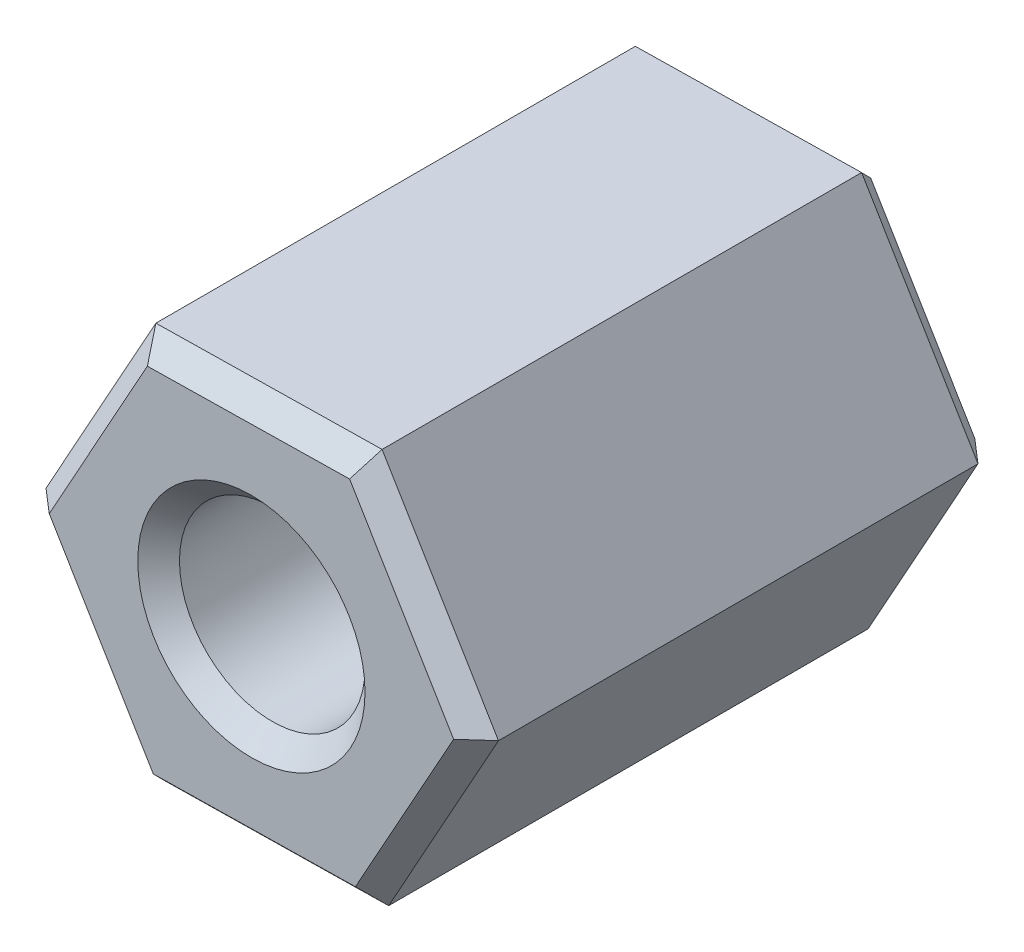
from build123d import *

# Parameters (mm, degrees)
EXTRUDE1_DEPTH        = 6.35
F_4_40_TAPPED_HOLE1_D = 2.2606
CHAMFER2_SIZE         = 0.254
CHAMFER3_SIZE         = 0.254
CHAMFER4_SIZE         = 0.254


with BuildPart() as part:
    # Sketch1 → Extrude1 (new body)
    with BuildSketch(Plane.XY):
        Polygon((2.756576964, 0.046135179), (1.338334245, 2.410333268), (-1.418242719, 2.364198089), (-2.756576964, -0.046135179), (-1.338334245, -2.410333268), (1.418242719, -2.364198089), align=None)
    extrude(amount=EXTRUDE1_DEPTH)

    # 4-40 Tapped Hole1 (through all)
    with Locations(Plane(origin=(0, 0, 0), x_dir=(1, 0, 0), z_dir=(0, 0, -1))):
        with Locations((0, 0)):
            Hole(F_4_40_TAPPED_HOLE1_D / 2)

    # Chamfer2
    chamfer2_edges = [part.edges().sort_by_distance(p)[0] for p in [
        (-0.039954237, 2.387265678, 6.35),
        (-2.087409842, 1.159031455, 6.35),
        (-2.047455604, -1.228234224, 6.35),
        (0.039954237, -2.387265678, 6.35),
        (2.087409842, -1.159031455, 6.35),
        (2.047455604, 1.228234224, 6.35),
    ]]
    chamfer(chamfer2_edges, length=CHAMFER2_SIZE)

    # Chamfer3
    chamfer3_edges = [part.edges().sort_by_distance(p)[0] for p in [
        (1.1303, 0, 6.35),
    ]]
    chamfer(chamfer3_edges, length=CHAMFER3_SIZE)

    # Chamfer4
    chamfer4_edges = [part.edges().sort_by_distance(p)[0] for p in [
        (1.1303, 0, 0),
        (0.039954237, -2.387265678, 0),
        (-2.047455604, -1.228234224, 0),
        (-2.087409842, 1.159031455, 0),
        (-0.039954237, 2.387265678, 0),
        (2.047455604, 1.228234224, 0),
        (2.087409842, -1.159031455, 0),
    ]]
    chamfer(chamfer4_edges, length=CHAMFER4_SIZE)


solid = part.part
